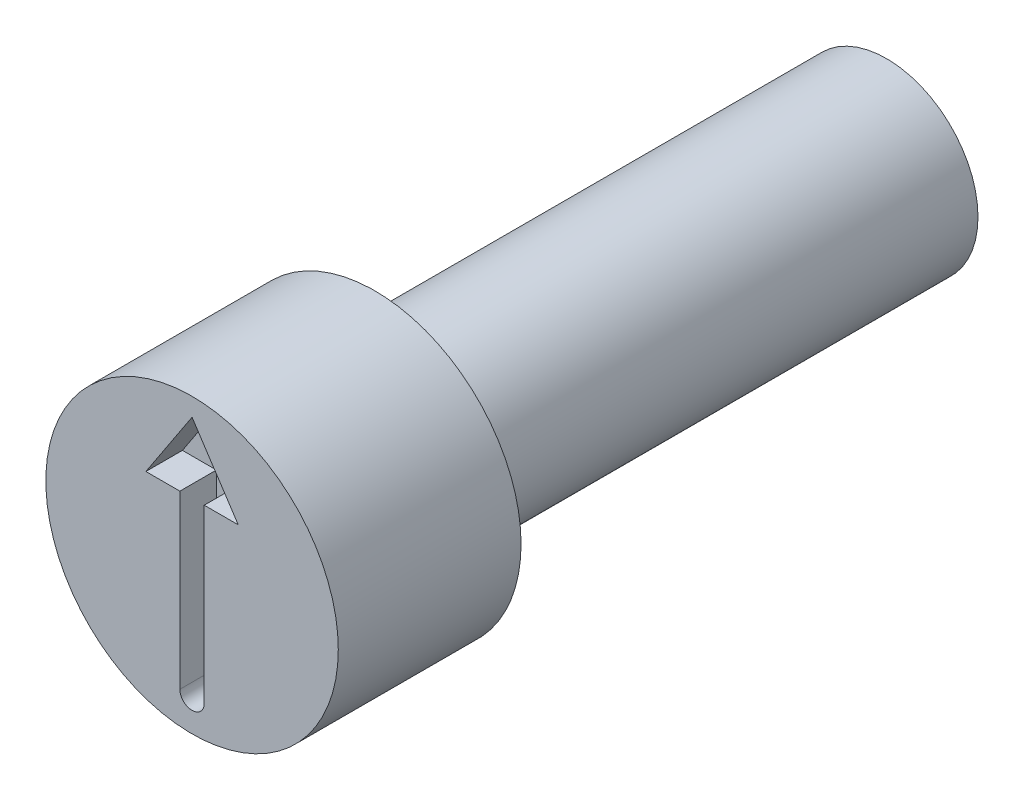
ISO-10303-21;
HEADER;
FILE_DESCRIPTION(('STEP AP214'),'2;1');
FILE_NAME('part.step','',(''),(''),'','','');
FILE_SCHEMA(('AUTOMOTIVE_DESIGN { 1 0 10303 214 1 1 1 1 }'));
ENDSEC;
DATA;
#1=APPLICATION_CONTEXT('core data for automotive mechanical design processes');
#2=APPLICATION_PROTOCOL_DEFINITION('international standard','automotive_design',2000,#1);
#3=PRODUCT_CONTEXT('',#1,'mechanical');
#4=PRODUCT('Part','Part','',(#3));
#5=PRODUCT_RELATED_PRODUCT_CATEGORY('part','',(#4));
#6=PRODUCT_DEFINITION_FORMATION('','',#4);
#7=PRODUCT_DEFINITION_CONTEXT('part definition',#1,'design');
#8=PRODUCT_DEFINITION('design','',#6,#7);
#9=PRODUCT_DEFINITION_SHAPE('','',#8);
#10=(LENGTH_UNIT() NAMED_UNIT(*) SI_UNIT(.MILLI.,.METRE.));
#11=(NAMED_UNIT(*) PLANE_ANGLE_UNIT() SI_UNIT($,.RADIAN.));
#12=(NAMED_UNIT(*) SI_UNIT($,.STERADIAN.) SOLID_ANGLE_UNIT());
#13=UNCERTAINTY_MEASURE_WITH_UNIT(LENGTH_MEASURE(1.E-05),#10,'distance_accuracy_value','');
#14=(GEOMETRIC_REPRESENTATION_CONTEXT(3) GLOBAL_UNCERTAINTY_ASSIGNED_CONTEXT((#13)) GLOBAL_UNIT_ASSIGNED_CONTEXT((#10,
#11,#12)) REPRESENTATION_CONTEXT('',''));
#15=CARTESIAN_POINT('',(0.,0.,0.));
#16=DIRECTION('',(0.,0.,1.));
#17=DIRECTION('',(1.,0.,0.));
#18=AXIS2_PLACEMENT_3D('',#15,#16,#17);
#19=CARTESIAN_POINT('',(0.,0.5,-1.));
#20=DIRECTION('',(0.,0.,1.));
#21=DIRECTION('',(1.,0.,0.));
#22=AXIS2_PLACEMENT_3D('',#19,#20,#21);
#23=PLANE('',#22);
#24=CARTESIAN_POINT('',(0.,0.,-1.));
#25=DIRECTION('',(0.,0.,1.));
#26=DIRECTION('',(1.,0.,0.));
#27=AXIS2_PLACEMENT_3D('',#24,#25,#26);
#28=CIRCLE('',#27,0.8);
#29=CARTESIAN_POINT('',(0.8,0.,-1.));
#30=VERTEX_POINT('',#29);
#31=EDGE_CURVE('E11',#30,#30,#28,.T.);
#32=ORIENTED_EDGE('',*,*,#31,.F.);
#33=EDGE_LOOP('',(#32));
#34=FACE_BOUND('',#33,.T.);
#35=CARTESIAN_POINT('',(0.,0.,-1.));
#36=DIRECTION('',(0.,0.,1.));
#37=DIRECTION('',(1.,0.,0.));
#38=AXIS2_PLACEMENT_3D('',#35,#36,#37);
#39=CIRCLE('',#38,0.5);
#40=CARTESIAN_POINT('',(0.5,0.,-1.));
#41=VERTEX_POINT('',#40);
#42=EDGE_CURVE('E144',#41,#41,#39,.T.);
#43=ORIENTED_EDGE('',*,*,#42,.T.);
#44=EDGE_LOOP('',(#43));
#45=FACE_BOUND('',#44,.T.);
#46=ADVANCED_FACE('F34',(#34,#45),#23,.F.);
#47=CARTESIAN_POINT('',(0.,0.,-0.403888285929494));
#48=DIRECTION('',(0.,0.,1.));
#49=DIRECTION('',(1.,0.,0.));
#50=AXIS2_PLACEMENT_3D('',#47,#48,#49);
#51=CYLINDRICAL_SURFACE('',#50,0.8);
#52=CARTESIAN_POINT('',(0.,0.,0.));
#53=DIRECTION('',(0.,0.,1.));
#54=DIRECTION('',(1.,0.,0.));
#55=AXIS2_PLACEMENT_3D('',#52,#53,#54);
#56=CIRCLE('',#55,0.8);
#57=CARTESIAN_POINT('',(0.8,0.,0.));
#58=VERTEX_POINT('',#57);
#59=EDGE_CURVE('E41',#58,#58,#56,.T.);
#60=ORIENTED_EDGE('',*,*,#59,.F.);
#61=EDGE_LOOP('',(#60));
#62=FACE_BOUND('',#61,.T.);
#63=ORIENTED_EDGE('',*,*,#31,.T.);
#64=EDGE_LOOP('',(#63));
#65=FACE_BOUND('',#64,.T.);
#66=ADVANCED_FACE('F161',(#62,#65),#51,.T.);
#67=CARTESIAN_POINT('',(0.,0.8,0.));
#68=DIRECTION('',(0.,0.,-1.));
#69=DIRECTION('',(-1.,0.,0.));
#70=AXIS2_PLACEMENT_3D('',#67,#68,#69);
#71=PLANE('',#70);
#72=DIRECTION('',(0.,1.,0.));
#73=VECTOR('',#72,1.);
#74=CARTESIAN_POINT('',(0.0666655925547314,0.31722300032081,0.));
#75=LINE('',#74,#73);
#76=CARTESIAN_POINT('',(0.0666655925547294,-0.62165664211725,0.));
#77=VERTEX_POINT('',#76);
#78=CARTESIAN_POINT('',(0.0666655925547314,0.31722300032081,0.));
#79=VERTEX_POINT('',#78);
#80=EDGE_CURVE('E128',#77,#79,#75,.T.);
#81=ORIENTED_EDGE('',*,*,#80,.F.);
#82=CARTESIAN_POINT('',(0.,-0.62165664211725,0.));
#83=DIRECTION('',(0.,0.,1.));
#84=DIRECTION('',(1.,0.,0.));
#85=AXIS2_PLACEMENT_3D('',#82,#83,#84);
#86=CIRCLE('',#85,0.0666655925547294);
#87=CARTESIAN_POINT('',(-0.0666655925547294,-0.62165664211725,0.));
#88=VERTEX_POINT('',#87);
#89=EDGE_CURVE('E48',#88,#77,#86,.T.);
#90=ORIENTED_EDGE('',*,*,#89,.F.);
#91=DIRECTION('',(0.,-1.,0.));
#92=VECTOR('',#91,1.);
#93=CARTESIAN_POINT('',(-0.0666655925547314,0.31722300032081,0.));
#94=LINE('',#93,#92);
#95=CARTESIAN_POINT('',(-0.0666655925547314,0.31722300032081,0.));
#96=VERTEX_POINT('',#95);
#97=EDGE_CURVE('E140',#96,#88,#94,.T.);
#98=ORIENTED_EDGE('',*,*,#97,.F.);
#99=DIRECTION('',(1.,0.,0.));
#100=VECTOR('',#99,1.);
#101=CARTESIAN_POINT('',(-0.252671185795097,0.31722300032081,0.));
#102=LINE('',#101,#100);
#103=CARTESIAN_POINT('',(-0.252671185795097,0.31722300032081,0.));
#104=VERTEX_POINT('',#103);
#105=EDGE_CURVE('E138',#104,#96,#102,.T.);
#106=ORIENTED_EDGE('',*,*,#105,.F.);
#107=DIRECTION('',(-0.550159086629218,-0.835059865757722,0.));
#108=VECTOR('',#107,1.);
#109=CARTESIAN_POINT('',(0.,0.700740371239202,0.));
#110=LINE('',#109,#108);
#111=CARTESIAN_POINT('',(0.,0.700740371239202,0.));
#112=VERTEX_POINT('',#111);
#113=EDGE_CURVE('E102',#112,#104,#110,.T.);
#114=ORIENTED_EDGE('',*,*,#113,.F.);
#115=DIRECTION('',(-0.550159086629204,0.835059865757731,0.));
#116=VECTOR('',#115,1.);
#117=CARTESIAN_POINT('',(0.,0.700740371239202,0.));
#118=LINE('',#117,#116);
#119=CARTESIAN_POINT('',(0.252671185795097,0.31722300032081,0.));
#120=VERTEX_POINT('',#119);
#121=EDGE_CURVE('E134',#120,#112,#118,.T.);
#122=ORIENTED_EDGE('',*,*,#121,.F.);
#123=DIRECTION('',(1.,0.,0.));
#124=VECTOR('',#123,1.);
#125=CARTESIAN_POINT('',(0.252671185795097,0.31722300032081,0.));
#126=LINE('',#125,#124);
#127=EDGE_CURVE('E131',#79,#120,#126,.T.);
#128=ORIENTED_EDGE('',*,*,#127,.F.);
#129=EDGE_LOOP('',(#81,#90,#98,#106,#114,#122,#128));
#130=FACE_BOUND('',#129,.T.);
#131=ORIENTED_EDGE('',*,*,#59,.T.);
#132=EDGE_LOOP('',(#131));
#133=FACE_BOUND('',#132,.T.);
#134=ADVANCED_FACE('F159',(#130,#133),#71,.F.);
#135=CARTESIAN_POINT('',(0.,0.,-3.8));
#136=DIRECTION('',(0.,0.,1.));
#137=DIRECTION('',(1.,0.,0.));
#138=AXIS2_PLACEMENT_3D('',#135,#136,#137);
#139=PLANE('',#138);
#140=CARTESIAN_POINT('',(0.,0.,-3.8));
#141=DIRECTION('',(0.,0.,1.));
#142=DIRECTION('',(1.,0.,0.));
#143=AXIS2_PLACEMENT_3D('',#140,#141,#142);
#144=CIRCLE('',#143,0.5);
#145=CARTESIAN_POINT('',(0.5,0.,-3.8));
#146=VERTEX_POINT('',#145);
#147=EDGE_CURVE('E154',#146,#146,#144,.T.);
#148=ORIENTED_EDGE('',*,*,#147,.F.);
#149=EDGE_LOOP('',(#148));
#150=FACE_BOUND('',#149,.T.);
#151=ADVANCED_FACE('F174',(#150),#139,.F.);
#152=CARTESIAN_POINT('',(0.,0.,-0.403888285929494));
#153=DIRECTION('',(0.,0.,1.));
#154=DIRECTION('',(1.,0.,0.));
#155=AXIS2_PLACEMENT_3D('',#152,#153,#154);
#156=CYLINDRICAL_SURFACE('',#155,0.5);
#157=ORIENTED_EDGE('',*,*,#42,.F.);
#158=EDGE_LOOP('',(#157));
#159=FACE_BOUND('',#158,.T.);
#160=ORIENTED_EDGE('',*,*,#147,.T.);
#161=EDGE_LOOP('',(#160));
#162=FACE_BOUND('',#161,.T.);
#163=ADVANCED_FACE('F170',(#159,#162),#156,.T.);
#164=CARTESIAN_POINT('',(0.,-0.62165664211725,-0.2));
#165=DIRECTION('',(0.,0.,1.));
#166=DIRECTION('',(1.,0.,0.));
#167=AXIS2_PLACEMENT_3D('',#164,#165,#166);
#168=CYLINDRICAL_SURFACE('',#167,0.0666655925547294);
#169=ORIENTED_EDGE('',*,*,#89,.T.);
#170=DIRECTION('',(0.,0.,1.));
#171=VECTOR('',#170,1.);
#172=CARTESIAN_POINT('',(0.0666655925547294,-0.62165664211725,-0.2));
#173=LINE('',#172,#171);
#174=CARTESIAN_POINT('',(0.0666655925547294,-0.62165664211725,-0.2));
#175=VERTEX_POINT('',#174);
#176=EDGE_CURVE('E81',#175,#77,#173,.T.);
#177=ORIENTED_EDGE('',*,*,#176,.F.);
#178=CARTESIAN_POINT('',(0.,-0.62165664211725,-0.2));
#179=DIRECTION('',(0.,0.,1.));
#180=DIRECTION('',(1.,0.,0.));
#181=AXIS2_PLACEMENT_3D('',#178,#179,#180);
#182=CIRCLE('',#181,0.0666655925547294);
#183=CARTESIAN_POINT('',(-0.0666655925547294,-0.62165664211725,-0.2));
#184=VERTEX_POINT('',#183);
#185=EDGE_CURVE('E142',#184,#175,#182,.T.);
#186=ORIENTED_EDGE('',*,*,#185,.F.);
#187=DIRECTION('',(0.,0.,1.));
#188=VECTOR('',#187,1.);
#189=CARTESIAN_POINT('',(-0.0666655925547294,-0.62165664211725,-0.2));
#190=LINE('',#189,#188);
#191=EDGE_CURVE('E56',#184,#88,#190,.T.);
#192=ORIENTED_EDGE('',*,*,#191,.T.);
#193=EDGE_LOOP('',(#169,#177,#186,#192));
#194=FACE_BOUND('',#193,.T.);
#195=ADVANCED_FACE('F173',(#194),#168,.F.);
#196=CARTESIAN_POINT('',(-0.0666655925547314,0.31722300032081,-0.2));
#197=DIRECTION('',(-1.,0.,0.));
#198=DIRECTION('',(0.,-1.,0.));
#199=AXIS2_PLACEMENT_3D('',#196,#197,#198);
#200=PLANE('',#199);
#201=ORIENTED_EDGE('',*,*,#97,.T.);
#202=ORIENTED_EDGE('',*,*,#191,.F.);
#203=DIRECTION('',(0.,-1.,0.));
#204=VECTOR('',#203,1.);
#205=CARTESIAN_POINT('',(-0.0666655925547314,0.31722300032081,-0.2));
#206=LINE('',#205,#204);
#207=CARTESIAN_POINT('',(-0.0666655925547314,0.31722300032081,-0.2));
#208=VERTEX_POINT('',#207);
#209=EDGE_CURVE('E114',#208,#184,#206,.T.);
#210=ORIENTED_EDGE('',*,*,#209,.F.);
#211=DIRECTION('',(0.,0.,1.));
#212=VECTOR('',#211,1.);
#213=CARTESIAN_POINT('',(-0.0666655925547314,0.31722300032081,-0.2));
#214=LINE('',#213,#212);
#215=EDGE_CURVE('E106',#208,#96,#214,.T.);
#216=ORIENTED_EDGE('',*,*,#215,.T.);
#217=EDGE_LOOP('',(#201,#202,#210,#216));
#218=FACE_BOUND('',#217,.T.);
#219=ADVANCED_FACE('F188',(#218),#200,.F.);
#220=CARTESIAN_POINT('',(-0.252671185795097,0.31722300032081,-0.2));
#221=DIRECTION('',(0.,-1.,0.));
#222=DIRECTION('',(0.,0.,-1.));
#223=AXIS2_PLACEMENT_3D('',#220,#221,#222);
#224=PLANE('',#223);
#225=ORIENTED_EDGE('',*,*,#105,.T.);
#226=ORIENTED_EDGE('',*,*,#215,.F.);
#227=DIRECTION('',(1.,0.,0.));
#228=VECTOR('',#227,1.);
#229=CARTESIAN_POINT('',(-0.252671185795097,0.31722300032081,-0.2));
#230=LINE('',#229,#228);
#231=CARTESIAN_POINT('',(-0.252671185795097,0.31722300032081,-0.2));
#232=VERTEX_POINT('',#231);
#233=EDGE_CURVE('E110',#232,#208,#230,.T.);
#234=ORIENTED_EDGE('',*,*,#233,.F.);
#235=DIRECTION('',(0.,0.,1.));
#236=VECTOR('',#235,1.);
#237=CARTESIAN_POINT('',(-0.252671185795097,0.31722300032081,-0.2));
#238=LINE('',#237,#236);
#239=EDGE_CURVE('E95',#232,#104,#238,.T.);
#240=ORIENTED_EDGE('',*,*,#239,.T.);
#241=EDGE_LOOP('',(#225,#226,#234,#240));
#242=FACE_BOUND('',#241,.T.);
#243=ADVANCED_FACE('F111',(#242),#224,.F.);
#244=CARTESIAN_POINT('',(0.,0.700740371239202,-0.2));
#245=DIRECTION('',(-0.835059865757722,0.550159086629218,0.));
#246=DIRECTION('',(-0.550159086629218,-0.835059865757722,0.));
#247=AXIS2_PLACEMENT_3D('',#244,#245,#246);
#248=PLANE('',#247);
#249=ORIENTED_EDGE('',*,*,#113,.T.);
#250=ORIENTED_EDGE('',*,*,#239,.F.);
#251=DIRECTION('',(-0.550159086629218,-0.835059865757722,0.));
#252=VECTOR('',#251,1.);
#253=CARTESIAN_POINT('',(0.,0.700740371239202,-0.2));
#254=LINE('',#253,#252);
#255=CARTESIAN_POINT('',(0.,0.700740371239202,-0.2));
#256=VERTEX_POINT('',#255);
#257=EDGE_CURVE('E99',#256,#232,#254,.T.);
#258=ORIENTED_EDGE('',*,*,#257,.F.);
#259=DIRECTION('',(0.,0.,1.));
#260=VECTOR('',#259,1.);
#261=CARTESIAN_POINT('',(0.,0.700740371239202,-0.2));
#262=LINE('',#261,#260);
#263=EDGE_CURVE('E107',#256,#112,#262,.T.);
#264=ORIENTED_EDGE('',*,*,#263,.T.);
#265=EDGE_LOOP('',(#249,#250,#258,#264));
#266=FACE_BOUND('',#265,.T.);
#267=ADVANCED_FACE('F97',(#266),#248,.F.);
#268=CARTESIAN_POINT('',(0.,0.700740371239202,-0.2));
#269=DIRECTION('',(0.835059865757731,0.550159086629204,0.));
#270=DIRECTION('',(-0.550159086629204,0.835059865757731,0.));
#271=AXIS2_PLACEMENT_3D('',#268,#269,#270);
#272=PLANE('',#271);
#273=ORIENTED_EDGE('',*,*,#121,.T.);
#274=ORIENTED_EDGE('',*,*,#263,.F.);
#275=DIRECTION('',(-0.550159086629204,0.835059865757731,0.));
#276=VECTOR('',#275,1.);
#277=CARTESIAN_POINT('',(0.,0.700740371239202,-0.2));
#278=LINE('',#277,#276);
#279=CARTESIAN_POINT('',(0.252671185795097,0.31722300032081,-0.2));
#280=VERTEX_POINT('',#279);
#281=EDGE_CURVE('E120',#280,#256,#278,.T.);
#282=ORIENTED_EDGE('',*,*,#281,.F.);
#283=DIRECTION('',(0.,0.,1.));
#284=VECTOR('',#283,1.);
#285=CARTESIAN_POINT('',(0.252671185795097,0.31722300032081,-0.2));
#286=LINE('',#285,#284);
#287=EDGE_CURVE('E147',#280,#120,#286,.T.);
#288=ORIENTED_EDGE('',*,*,#287,.T.);
#289=EDGE_LOOP('',(#273,#274,#282,#288));
#290=FACE_BOUND('',#289,.T.);
#291=ADVANCED_FACE('F196',(#290),#272,.F.);
#292=CARTESIAN_POINT('',(0.252671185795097,0.31722300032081,-0.2));
#293=DIRECTION('',(0.,-1.,0.));
#294=DIRECTION('',(0.,0.,-1.));
#295=AXIS2_PLACEMENT_3D('',#292,#293,#294);
#296=PLANE('',#295);
#297=ORIENTED_EDGE('',*,*,#127,.T.);
#298=ORIENTED_EDGE('',*,*,#287,.F.);
#299=DIRECTION('',(1.,0.,0.));
#300=VECTOR('',#299,1.);
#301=CARTESIAN_POINT('',(0.252671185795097,0.31722300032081,-0.2));
#302=LINE('',#301,#300);
#303=CARTESIAN_POINT('',(0.0666655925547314,0.31722300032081,-0.2));
#304=VERTEX_POINT('',#303);
#305=EDGE_CURVE('E122',#304,#280,#302,.T.);
#306=ORIENTED_EDGE('',*,*,#305,.F.);
#307=DIRECTION('',(0.,0.,1.));
#308=VECTOR('',#307,1.);
#309=CARTESIAN_POINT('',(0.0666655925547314,0.31722300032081,-0.2));
#310=LINE('',#309,#308);
#311=EDGE_CURVE('E149',#304,#79,#310,.T.);
#312=ORIENTED_EDGE('',*,*,#311,.T.);
#313=EDGE_LOOP('',(#297,#298,#306,#312));
#314=FACE_BOUND('',#313,.T.);
#315=ADVANCED_FACE('F192',(#314),#296,.F.);
#316=CARTESIAN_POINT('',(0.0666655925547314,0.31722300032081,-0.2));
#317=DIRECTION('',(1.,0.,0.));
#318=DIRECTION('',(0.,1.,0.));
#319=AXIS2_PLACEMENT_3D('',#316,#317,#318);
#320=PLANE('',#319);
#321=ORIENTED_EDGE('',*,*,#80,.T.);
#322=ORIENTED_EDGE('',*,*,#311,.F.);
#323=DIRECTION('',(0.,1.,0.));
#324=VECTOR('',#323,1.);
#325=CARTESIAN_POINT('',(0.0666655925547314,0.31722300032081,-0.2));
#326=LINE('',#325,#324);
#327=EDGE_CURVE('E290',#175,#304,#326,.T.);
#328=ORIENTED_EDGE('',*,*,#327,.F.);
#329=ORIENTED_EDGE('',*,*,#176,.T.);
#330=EDGE_LOOP('',(#321,#322,#328,#329));
#331=FACE_BOUND('',#330,.T.);
#332=ADVANCED_FACE('F189',(#331),#320,.F.);
#333=CARTESIAN_POINT('',(0.,-0.62165664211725,-0.2));
#334=DIRECTION('',(0.,0.,1.));
#335=DIRECTION('',(1.,0.,0.));
#336=AXIS2_PLACEMENT_3D('',#333,#334,#335);
#337=PLANE('',#336);
#338=ORIENTED_EDGE('',*,*,#185,.T.);
#339=ORIENTED_EDGE('',*,*,#327,.T.);
#340=ORIENTED_EDGE('',*,*,#305,.T.);
#341=ORIENTED_EDGE('',*,*,#281,.T.);
#342=ORIENTED_EDGE('',*,*,#257,.T.);
#343=ORIENTED_EDGE('',*,*,#233,.T.);
#344=ORIENTED_EDGE('',*,*,#209,.T.);
#345=EDGE_LOOP('',(#338,#339,#340,#341,#342,#343,#344));
#346=FACE_BOUND('',#345,.T.);
#347=ADVANCED_FACE('F117',(#346),#337,.T.);
#348=CLOSED_SHELL('',(#46,#66,#134,#151,#163,#195,#219,#243,#267,#291,#315,#332,#347));
#349=MANIFOLD_SOLID_BREP('B2',#348);
#350=ADVANCED_BREP_SHAPE_REPRESENTATION('',(#18,#349),#14);
#351=SHAPE_DEFINITION_REPRESENTATION(#9,#350);
ENDSEC;
END-ISO-10303-21;
